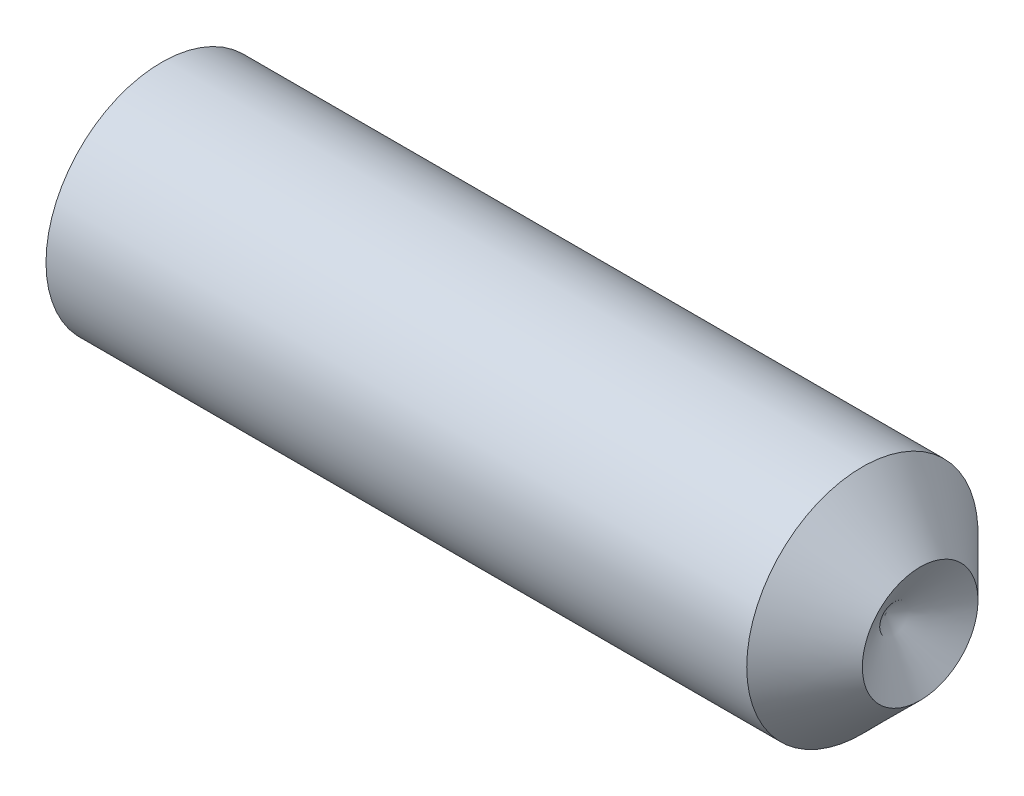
ISO-10303-21;
HEADER;
FILE_DESCRIPTION(('STEP AP214'),'2;1');
FILE_NAME('part.step','',(''),(''),'','','');
FILE_SCHEMA(('AUTOMOTIVE_DESIGN { 1 0 10303 214 1 1 1 1 }'));
ENDSEC;
DATA;
#1=APPLICATION_CONTEXT('core data for automotive mechanical design processes');
#2=APPLICATION_PROTOCOL_DEFINITION('international standard','automotive_design',2000,#1);
#3=PRODUCT_CONTEXT('',#1,'mechanical');
#4=PRODUCT('Part','Part','',(#3));
#5=PRODUCT_RELATED_PRODUCT_CATEGORY('part','',(#4));
#6=PRODUCT_DEFINITION_FORMATION('','',#4);
#7=PRODUCT_DEFINITION_CONTEXT('part definition',#1,'design');
#8=PRODUCT_DEFINITION('design','',#6,#7);
#9=PRODUCT_DEFINITION_SHAPE('','',#8);
#10=(LENGTH_UNIT() NAMED_UNIT(*) SI_UNIT(.MILLI.,.METRE.));
#11=(NAMED_UNIT(*) PLANE_ANGLE_UNIT() SI_UNIT($,.RADIAN.));
#12=(NAMED_UNIT(*) SI_UNIT($,.STERADIAN.) SOLID_ANGLE_UNIT());
#13=UNCERTAINTY_MEASURE_WITH_UNIT(LENGTH_MEASURE(1.E-05),#10,'distance_accuracy_value','');
#14=(GEOMETRIC_REPRESENTATION_CONTEXT(3) GLOBAL_UNCERTAINTY_ASSIGNED_CONTEXT((#13)) GLOBAL_UNIT_ASSIGNED_CONTEXT((#10,
#11,#12)) REPRESENTATION_CONTEXT('',''));
#15=CARTESIAN_POINT('',(0.,0.,0.));
#16=DIRECTION('',(0.,0.,1.));
#17=DIRECTION('',(1.,0.,0.));
#18=AXIS2_PLACEMENT_3D('',#15,#16,#17);
#19=CARTESIAN_POINT('',(0.,0.,0.));
#20=DIRECTION('',(-1.,0.,0.));
#21=DIRECTION('',(0.,0.,1.));
#22=AXIS2_PLACEMENT_3D('',#19,#20,#21);
#23=PLANE('',#22);
#24=CARTESIAN_POINT('',(0.,0.,0.));
#25=DIRECTION('',(-1.,0.,0.));
#26=DIRECTION('',(0.,0.,1.));
#27=AXIS2_PLACEMENT_3D('',#24,#25,#26);
#28=CIRCLE('',#27,2.4455);
#29=CARTESIAN_POINT('',(0.,0.,2.4455));
#30=VERTEX_POINT('',#29);
#31=EDGE_CURVE('E11',#30,#30,#28,.T.);
#32=ORIENTED_EDGE('',*,*,#31,.T.);
#33=EDGE_LOOP('',(#32));
#34=FACE_BOUND('',#33,.T.);
#35=DIRECTION('',(0.,0.,-1.));
#36=VECTOR('',#35,1.);
#37=CARTESIAN_POINT('',(0.,1.5,0.866025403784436));
#38=LINE('',#37,#36);
#39=CARTESIAN_POINT('',(0.,1.5,0.866025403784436));
#40=VERTEX_POINT('',#39);
#41=CARTESIAN_POINT('',(0.,1.5,-0.866025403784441));
#42=VERTEX_POINT('',#41);
#43=EDGE_CURVE('E112',#40,#42,#38,.T.);
#44=ORIENTED_EDGE('',*,*,#43,.F.);
#45=DIRECTION('',(0.,-0.866025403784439,0.5));
#46=VECTOR('',#45,1.);
#47=CARTESIAN_POINT('',(0.,1.5,0.866025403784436));
#48=LINE('',#47,#46);
#49=CARTESIAN_POINT('',(0.,0.,1.73205080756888));
#50=VERTEX_POINT('',#49);
#51=EDGE_CURVE('E54',#40,#50,#48,.T.);
#52=ORIENTED_EDGE('',*,*,#51,.T.);
#53=DIRECTION('',(0.,0.866025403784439,0.5));
#54=VECTOR('',#53,1.);
#55=CARTESIAN_POINT('',(0.,-1.5,0.866025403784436));
#56=LINE('',#55,#54);
#57=CARTESIAN_POINT('',(0.,-1.5,0.866025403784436));
#58=VERTEX_POINT('',#57);
#59=EDGE_CURVE('E102',#58,#50,#56,.T.);
#60=ORIENTED_EDGE('',*,*,#59,.F.);
#61=DIRECTION('',(0.,0.,-1.));
#62=VECTOR('',#61,1.);
#63=CARTESIAN_POINT('',(0.,-1.5,0.866025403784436));
#64=LINE('',#63,#62);
#65=CARTESIAN_POINT('',(0.,-1.5,-0.866025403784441));
#66=VERTEX_POINT('',#65);
#67=EDGE_CURVE('E107',#58,#66,#64,.T.);
#68=ORIENTED_EDGE('',*,*,#67,.T.);
#69=DIRECTION('',(0.,0.866025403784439,-0.5));
#70=VECTOR('',#69,1.);
#71=CARTESIAN_POINT('',(0.,-1.5,-0.866025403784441));
#72=LINE('',#71,#70);
#73=CARTESIAN_POINT('',(0.,0.,-1.73205080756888));
#74=VERTEX_POINT('',#73);
#75=EDGE_CURVE('E116',#66,#74,#72,.T.);
#76=ORIENTED_EDGE('',*,*,#75,.T.);
#77=DIRECTION('',(0.,-0.866025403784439,-0.5));
#78=VECTOR('',#77,1.);
#79=CARTESIAN_POINT('',(0.,1.5,-0.866025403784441));
#80=LINE('',#79,#78);
#81=EDGE_CURVE('E119',#42,#74,#80,.T.);
#82=ORIENTED_EDGE('',*,*,#81,.F.);
#83=EDGE_LOOP('',(#44,#52,#60,#68,#76,#82));
#84=FACE_BOUND('',#83,.T.);
#85=ADVANCED_FACE('F40',(#34,#84),#23,.T.);
#86=CARTESIAN_POINT('',(0.,0.,0.));
#87=DIRECTION('',(1.,0.,0.));
#88=DIRECTION('',(0.,0.,-1.));
#89=AXIS2_PLACEMENT_3D('',#86,#87,#88);
#90=CONICAL_SURFACE('',#89,2.4455,1.0471975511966);
#91=CARTESIAN_POINT('',(0.320140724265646,0.,0.));
#92=DIRECTION('',(-1.,0.,0.));
#93=DIRECTION('',(0.,0.,1.));
#94=AXIS2_PLACEMENT_3D('',#91,#92,#93);
#95=CIRCLE('',#94,3.);
#96=CARTESIAN_POINT('',(0.320140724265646,0.,3.));
#97=VERTEX_POINT('',#96);
#98=EDGE_CURVE('E47',#97,#97,#95,.T.);
#99=ORIENTED_EDGE('',*,*,#98,.T.);
#100=EDGE_LOOP('',(#99));
#101=FACE_BOUND('',#100,.T.);
#102=ORIENTED_EDGE('',*,*,#31,.F.);
#103=EDGE_LOOP('',(#102));
#104=FACE_BOUND('',#103,.T.);
#105=ADVANCED_FACE('F152',(#101,#104),#90,.T.);
#106=CARTESIAN_POINT('',(-12.7,0.,0.));
#107=DIRECTION('',(-1.,0.,0.));
#108=DIRECTION('',(0.,0.,1.));
#109=AXIS2_PLACEMENT_3D('',#106,#107,#108);
#110=CYLINDRICAL_SURFACE('',#109,3.);
#111=CARTESIAN_POINT('',(18.5,0.,0.));
#112=DIRECTION('',(-1.,0.,0.));
#113=DIRECTION('',(0.,0.,1.));
#114=AXIS2_PLACEMENT_3D('',#111,#112,#113);
#115=CIRCLE('',#114,3.);
#116=CARTESIAN_POINT('',(18.5,0.,3.));
#117=VERTEX_POINT('',#116);
#118=EDGE_CURVE('E147',#117,#117,#115,.T.);
#119=ORIENTED_EDGE('',*,*,#118,.T.);
#120=EDGE_LOOP('',(#119));
#121=FACE_BOUND('',#120,.T.);
#122=ORIENTED_EDGE('',*,*,#98,.F.);
#123=EDGE_LOOP('',(#122));
#124=FACE_BOUND('',#123,.T.);
#125=ADVANCED_FACE('F155',(#121,#124),#110,.T.);
#126=CARTESIAN_POINT('',(18.5,0.,0.));
#127=DIRECTION('',(-1.,0.,0.));
#128=DIRECTION('',(0.,0.,1.));
#129=AXIS2_PLACEMENT_3D('',#126,#127,#128);
#130=CONICAL_SURFACE('',#129,3.,0.785398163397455);
#131=CARTESIAN_POINT('',(20.,0.,0.));
#132=DIRECTION('',(-1.,0.,0.));
#133=DIRECTION('',(0.,0.,1.));
#134=AXIS2_PLACEMENT_3D('',#131,#132,#133);
#135=CIRCLE('',#134,1.5);
#136=CARTESIAN_POINT('',(20.,0.,1.5));
#137=VERTEX_POINT('',#136);
#138=EDGE_CURVE('E98',#137,#137,#135,.T.);
#139=ORIENTED_EDGE('',*,*,#138,.T.);
#140=EDGE_LOOP('',(#139));
#141=FACE_BOUND('',#140,.T.);
#142=ORIENTED_EDGE('',*,*,#118,.F.);
#143=EDGE_LOOP('',(#142));
#144=FACE_BOUND('',#143,.T.);
#145=ADVANCED_FACE('F157',(#141,#144),#130,.T.);
#146=CARTESIAN_POINT('',(19.0987090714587,0.,0.));
#147=DIRECTION('',(1.,0.,0.));
#148=DIRECTION('',(0.,0.,-1.));
#149=AXIS2_PLACEMENT_3D('',#146,#147,#148);
#150=CONICAL_SURFACE('',#149,0.,1.02974425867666);
#151=ORIENTED_EDGE('',*,*,#138,.F.);
#152=EDGE_LOOP('',(#151));
#153=FACE_BOUND('',#152,.T.);
#154=CARTESIAN_POINT('',(19.0987090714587,0.,0.));
#155=VERTEX_POINT('',#154);
#156=VERTEX_LOOP('',#155);
#157=FACE_BOUND('',#156,.T.);
#158=ADVANCED_FACE('F164',(#153,#157),#150,.F.);
#159=CARTESIAN_POINT('',(3.,1.5,0.866025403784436));
#160=DIRECTION('',(0.,-0.5,-0.866025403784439));
#161=DIRECTION('',(0.,0.866025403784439,-0.5));
#162=AXIS2_PLACEMENT_3D('',#159,#160,#161);
#163=PLANE('',#162);
#164=ORIENTED_EDGE('',*,*,#51,.F.);
#165=DIRECTION('',(-1.,0.,0.));
#166=VECTOR('',#165,1.);
#167=CARTESIAN_POINT('',(3.,1.5,0.866025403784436));
#168=LINE('',#167,#166);
#169=CARTESIAN_POINT('',(3.,1.5,0.866025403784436));
#170=VERTEX_POINT('',#169);
#171=EDGE_CURVE('E136',#170,#40,#168,.T.);
#172=ORIENTED_EDGE('',*,*,#171,.F.);
#173=DIRECTION('',(0.,-0.866025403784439,0.5));
#174=VECTOR('',#173,1.);
#175=CARTESIAN_POINT('',(3.,1.5,0.866025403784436));
#176=LINE('',#175,#174);
#177=CARTESIAN_POINT('',(3.,0.,1.73205080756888));
#178=VERTEX_POINT('',#177);
#179=EDGE_CURVE('E94',#170,#178,#176,.T.);
#180=ORIENTED_EDGE('',*,*,#179,.T.);
#181=DIRECTION('',(-1.,0.,0.));
#182=VECTOR('',#181,1.);
#183=CARTESIAN_POINT('',(3.,0.,1.73205080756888));
#184=LINE('',#183,#182);
#185=EDGE_CURVE('E90',#178,#50,#184,.T.);
#186=ORIENTED_EDGE('',*,*,#185,.T.);
#187=EDGE_LOOP('',(#164,#172,#180,#186));
#188=FACE_BOUND('',#187,.T.);
#189=ADVANCED_FACE('F92',(#188),#163,.T.);
#190=CARTESIAN_POINT('',(3.,-1.5,0.866025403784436));
#191=DIRECTION('',(0.,-0.5,0.866025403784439));
#192=DIRECTION('',(0.,-0.866025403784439,-0.5));
#193=AXIS2_PLACEMENT_3D('',#190,#191,#192);
#194=PLANE('',#193);
#195=ORIENTED_EDGE('',*,*,#59,.T.);
#196=ORIENTED_EDGE('',*,*,#185,.F.);
#197=DIRECTION('',(0.,0.866025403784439,0.5));
#198=VECTOR('',#197,1.);
#199=CARTESIAN_POINT('',(3.,-1.5,0.866025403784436));
#200=LINE('',#199,#198);
#201=CARTESIAN_POINT('',(3.,-1.5,0.866025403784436));
#202=VERTEX_POINT('',#201);
#203=EDGE_CURVE('E124',#202,#178,#200,.T.);
#204=ORIENTED_EDGE('',*,*,#203,.F.);
#205=DIRECTION('',(-1.,0.,0.));
#206=VECTOR('',#205,1.);
#207=CARTESIAN_POINT('',(3.,-1.5,0.866025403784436));
#208=LINE('',#207,#206);
#209=EDGE_CURVE('E99',#202,#58,#208,.T.);
#210=ORIENTED_EDGE('',*,*,#209,.T.);
#211=EDGE_LOOP('',(#195,#196,#204,#210));
#212=FACE_BOUND('',#211,.T.);
#213=ADVANCED_FACE('F103',(#212),#194,.F.);
#214=CARTESIAN_POINT('',(3.,-1.5,0.866025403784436));
#215=DIRECTION('',(0.,1.,0.));
#216=DIRECTION('',(0.,0.,1.));
#217=AXIS2_PLACEMENT_3D('',#214,#215,#216);
#218=PLANE('',#217);
#219=ORIENTED_EDGE('',*,*,#67,.F.);
#220=ORIENTED_EDGE('',*,*,#209,.F.);
#221=DIRECTION('',(0.,0.,-1.));
#222=VECTOR('',#221,1.);
#223=CARTESIAN_POINT('',(3.,-1.5,0.866025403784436));
#224=LINE('',#223,#222);
#225=CARTESIAN_POINT('',(3.,-1.5,-0.866025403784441));
#226=VERTEX_POINT('',#225);
#227=EDGE_CURVE('E126',#202,#226,#224,.T.);
#228=ORIENTED_EDGE('',*,*,#227,.T.);
#229=DIRECTION('',(-1.,0.,0.));
#230=VECTOR('',#229,1.);
#231=CARTESIAN_POINT('',(3.,-1.5,-0.866025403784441));
#232=LINE('',#231,#230);
#233=EDGE_CURVE('E142',#226,#66,#232,.T.);
#234=ORIENTED_EDGE('',*,*,#233,.T.);
#235=EDGE_LOOP('',(#219,#220,#228,#234));
#236=FACE_BOUND('',#235,.T.);
#237=ADVANCED_FACE('F213',(#236),#218,.T.);
#238=CARTESIAN_POINT('',(3.,-1.5,-0.866025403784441));
#239=DIRECTION('',(0.,0.5,0.866025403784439));
#240=DIRECTION('',(0.,-0.866025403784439,0.5));
#241=AXIS2_PLACEMENT_3D('',#238,#239,#240);
#242=PLANE('',#241);
#243=ORIENTED_EDGE('',*,*,#75,.F.);
#244=ORIENTED_EDGE('',*,*,#233,.F.);
#245=DIRECTION('',(0.,0.866025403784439,-0.5));
#246=VECTOR('',#245,1.);
#247=CARTESIAN_POINT('',(3.,-1.5,-0.866025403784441));
#248=LINE('',#247,#246);
#249=CARTESIAN_POINT('',(3.,0.,-1.73205080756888));
#250=VERTEX_POINT('',#249);
#251=EDGE_CURVE('E128',#226,#250,#248,.T.);
#252=ORIENTED_EDGE('',*,*,#251,.T.);
#253=DIRECTION('',(-1.,0.,0.));
#254=VECTOR('',#253,1.);
#255=CARTESIAN_POINT('',(3.,0.,-1.73205080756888));
#256=LINE('',#255,#254);
#257=EDGE_CURVE('E140',#250,#74,#256,.T.);
#258=ORIENTED_EDGE('',*,*,#257,.T.);
#259=EDGE_LOOP('',(#243,#244,#252,#258));
#260=FACE_BOUND('',#259,.T.);
#261=ADVANCED_FACE('F220',(#260),#242,.T.);
#262=CARTESIAN_POINT('',(3.,1.5,-0.866025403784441));
#263=DIRECTION('',(0.,0.5,-0.866025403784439));
#264=DIRECTION('',(0.,0.866025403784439,0.5));
#265=AXIS2_PLACEMENT_3D('',#262,#263,#264);
#266=PLANE('',#265);
#267=ORIENTED_EDGE('',*,*,#81,.T.);
#268=ORIENTED_EDGE('',*,*,#257,.F.);
#269=DIRECTION('',(0.,-0.866025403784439,-0.5));
#270=VECTOR('',#269,1.);
#271=CARTESIAN_POINT('',(3.,1.5,-0.866025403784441));
#272=LINE('',#271,#270);
#273=CARTESIAN_POINT('',(3.,1.5,-0.866025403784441));
#274=VERTEX_POINT('',#273);
#275=EDGE_CURVE('E130',#274,#250,#272,.T.);
#276=ORIENTED_EDGE('',*,*,#275,.F.);
#277=DIRECTION('',(-1.,0.,0.));
#278=VECTOR('',#277,1.);
#279=CARTESIAN_POINT('',(3.,1.5,-0.866025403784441));
#280=LINE('',#279,#278);
#281=EDGE_CURVE('E138',#274,#42,#280,.T.);
#282=ORIENTED_EDGE('',*,*,#281,.T.);
#283=EDGE_LOOP('',(#267,#268,#276,#282));
#284=FACE_BOUND('',#283,.T.);
#285=ADVANCED_FACE('F228',(#284),#266,.F.);
#286=CARTESIAN_POINT('',(3.,1.5,0.866025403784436));
#287=DIRECTION('',(0.,1.,0.));
#288=DIRECTION('',(0.,0.,1.));
#289=AXIS2_PLACEMENT_3D('',#286,#287,#288);
#290=PLANE('',#289);
#291=ORIENTED_EDGE('',*,*,#43,.T.);
#292=ORIENTED_EDGE('',*,*,#281,.F.);
#293=DIRECTION('',(0.,0.,-1.));
#294=VECTOR('',#293,1.);
#295=CARTESIAN_POINT('',(3.,1.5,0.866025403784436));
#296=LINE('',#295,#294);
#297=EDGE_CURVE('E133',#170,#274,#296,.T.);
#298=ORIENTED_EDGE('',*,*,#297,.F.);
#299=ORIENTED_EDGE('',*,*,#171,.T.);
#300=EDGE_LOOP('',(#291,#292,#298,#299));
#301=FACE_BOUND('',#300,.T.);
#302=ADVANCED_FACE('F236',(#301),#290,.F.);
#303=CARTESIAN_POINT('',(3.,1.5,0.866025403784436));
#304=DIRECTION('',(1.,0.,0.));
#305=DIRECTION('',(0.,0.,-1.));
#306=AXIS2_PLACEMENT_3D('',#303,#304,#305);
#307=PLANE('',#306);
#308=ORIENTED_EDGE('',*,*,#179,.F.);
#309=ORIENTED_EDGE('',*,*,#297,.T.);
#310=ORIENTED_EDGE('',*,*,#275,.T.);
#311=ORIENTED_EDGE('',*,*,#251,.F.);
#312=ORIENTED_EDGE('',*,*,#227,.F.);
#313=ORIENTED_EDGE('',*,*,#203,.T.);
#314=EDGE_LOOP('',(#308,#309,#310,#311,#312,#313));
#315=FACE_BOUND('',#314,.T.);
#316=ADVANCED_FACE('F244',(#315),#307,.F.);
#317=CLOSED_SHELL('',(#85,#105,#125,#145,#158,#189,#213,#237,#261,#285,#302,#316));
#318=MANIFOLD_SOLID_BREP('B2',#317);
#319=ADVANCED_BREP_SHAPE_REPRESENTATION('',(#18,#318),#14);
#320=SHAPE_DEFINITION_REPRESENTATION(#9,#319);
ENDSEC;
END-ISO-10303-21;
